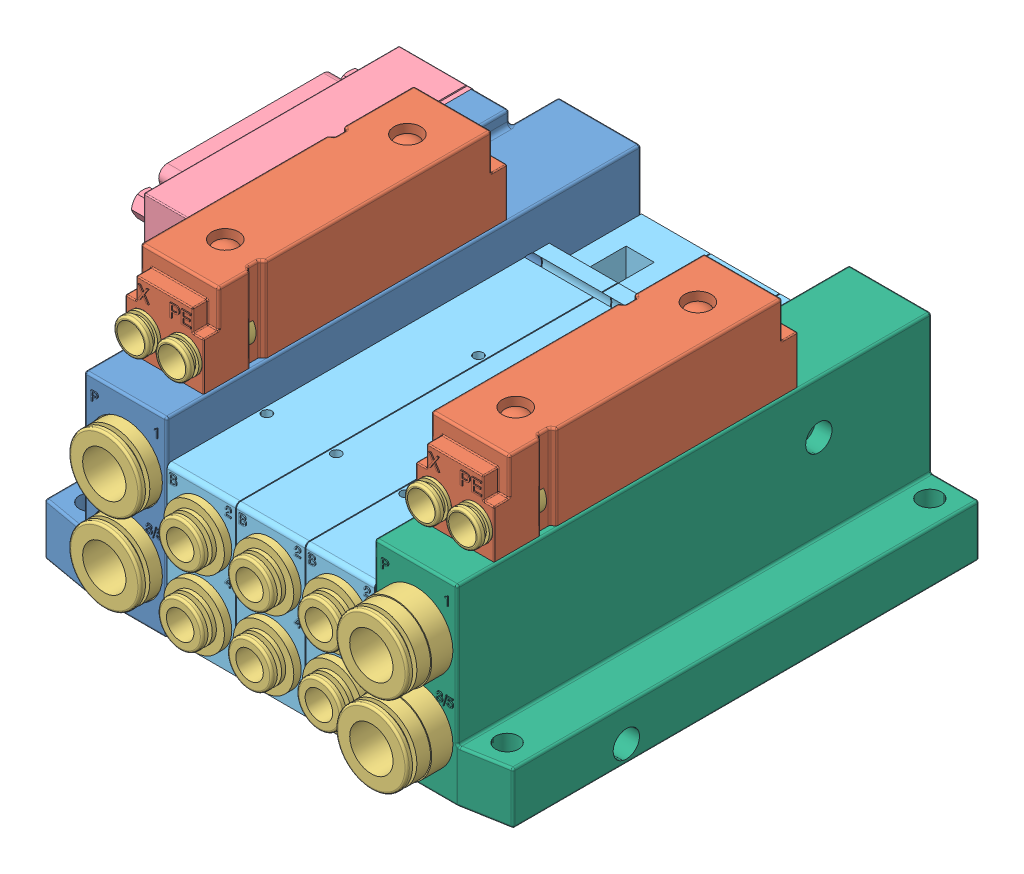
SolidWorks assembly 45642-048.SLDASM, configuration SS5V2-10FD2-06BR-N7 (file format 4400). Lengths in mm.
Overall size (128.4 63.5 119.7).
31 component instances, 7 part files, 6 mates.
Components (placement in the parent):
- SS5V2-10FD2-06BR-N7_Input Block-1: SS5V2-10FD2-06BR-N7_Input Block.sldasm [10F2-R] at origin size (50.4 63.5 114.3)
  - SS5V2-10FD2-06BR-N7_Input Side End Plate-1: SS5V2-10FD2-06BR-N7_Input Side End Plate.sldprt [10] at (-9.5 22 1.3) size (30 47.25 109.72)
  - Rail Clamp-1: Rail Clamp.sldprt [Default] at (-24 0 -8.5) x (-1 0 0) z (0 0 -1) (suppressed, hidden)
  - Rail Clamp-2: Rail Clamp.sldprt [0] at (-22.5 10 -7.8) x (-1 0 0) z (0 0 -1) (suppressed, hidden)
  - SS5V2-10FD2-06BR-N7_Exhaust Cap-1: SS5V2-10FD2-06BR-N7_Exhaust Cap.SLDPRT [R] at (-9.5 55 12) size (18.3 19.5 70.25)
  - SS5V2-10FD2-06BR-N7_Fittings-4: SS5V2-10FD2-06BR-N7_Fittings.sldprt [1000-51A-N11] at (-9.5 30.6 26.4) size (17 17 34.5)
  - SS5V2-10FD2-06BR-N7_Fittings-3: SS5V2-10FD2-06BR-N7_Fittings.sldprt [1000-51A-N11] at (-9.5 11.9 26.4) size (17 17 34.5)
  - SS5V2-10FD2-06BR-N7_Fittings-2: SS5V2-10FD2-06BR-N7_Fittings.sldprt [0000-50A-N3] at (-14.3 49.9 34.6) size (8 8 15.4)
  - SS5V2-10FD2-06BR-N7_Fittings-1: SS5V2-10FD2-06BR-N7_Fittings.sldprt [0000-50A-N3] at (-4.8 49.9 34.6) size (8 8 15.4)
  - SS5V2-10FD2-06BR-N7_Connector-1: SS5V2-10FD2-06BR-N7_Connector.sldprt [F2] at (-27.4 29.75 -12.55) x (0 0 1) z (-1 0 0) size (58.9 35 23)
- SS5V2-10FD2-06BR-N7_Base-1: SS5V2-10FD2-06BR-N7_Base.sldasm [W10S-N7] at (8 17.75 1.3) size (16 34.5 114.3)
  - SS5V2-10FD2-06BR-N7_Valve Base-1: SS5V2-10FD2-06BR-N7_Valve Base.SLDPRT [W10S] at origin size (16 34.5 109.65)
  - SS5V2-10FD2-06BR-N7_Fittings-2: SS5V2-10FD2-06BR-N7_Fittings.sldprt [1000-51A-N7] at (0 7.45 41.3) size (14 14 18.3)
  - SS5V2-10FD2-06BR-N7_Fittings-1: SS5V2-10FD2-06BR-N7_Fittings.sldprt [1000-51A-N7] at (0 -8.55 41.3) size (14 14 18.3)
- SS5V2-10FD2-06BR-N7_Exhaust Side-1: SS5V2-10FD2-06BR-N7_Exhaust Side.sldasm [W10S-R] at (48 0 0) size (30 63.5 119.7)
  - SS5V2-10FD2-06BR-N7_D Side End Plate-1: SS5V2-10FD2-06BR-N7_D Side End Plate.sldprt [W10S] at (9.5 0 1.3) size (30 44 109.72)
  - Rail Clamp-1: Rail Clamp.sldprt [Default] at (24 0 -8.5) x (-1 0 0) z (0 0 -1) (suppressed, hidden)
  - Rail Clamp-2: Rail Clamp.sldprt [0] at (22.5 10 -7.8) x (-1 0 0) z (0 0 -1) (suppressed, hidden)
  - SS5V2-10FD2-06BR-N7_Exhaust Cap-1: SS5V2-10FD2-06BR-N7_Exhaust Cap.SLDPRT [R] at (9.5 55 12) size (18.3 19.5 70.25)
  - SS5V2-10FD2-06BR-N7_Fittings-4: SS5V2-10FD2-06BR-N7_Fittings.sldprt [1000-51A-N11] at (9.5 30.6 31.8) size (17 17 34.5)
  - SS5V2-10FD2-06BR-N7_Fittings-3: SS5V2-10FD2-06BR-N7_Fittings.sldprt [1000-51A-N11] at (9.5 11.9 31.8) size (17 17 34.5)
  - SS5V2-10FD2-06BR-N7_Fittings-2: SS5V2-10FD2-06BR-N7_Fittings.sldprt [0000-50A-N3] at (4.7 49.9 34.6) size (8 8 15.4)
  - SS5V2-10FD2-06BR-N7_Fittings-1: SS5V2-10FD2-06BR-N7_Fittings.sldprt [0000-50A-N3] at (14.2 49.9 34.6) size (8 8 15.4)
- SS5V2-10FD2-06BR-N7_Base-2: SS5V2-10FD2-06BR-N7_Base.sldasm [W10S-N7] at (24 17.75 1.3) size (16 34.5 114.3)
  - SS5V2-10FD2-06BR-N7_Valve Base-1: SS5V2-10FD2-06BR-N7_Valve Base.SLDPRT [W10S] at origin size (16 34.5 109.65)
  - SS5V2-10FD2-06BR-N7_Fittings-2: SS5V2-10FD2-06BR-N7_Fittings.sldprt [1000-51A-N7] at (0 7.45 41.3) size (14 14 18.3)
  - SS5V2-10FD2-06BR-N7_Fittings-1: SS5V2-10FD2-06BR-N7_Fittings.sldprt [1000-51A-N7] at (0 -8.55 41.3) size (14 14 18.3)
- SS5V2-10FD2-06BR-N7_Base-3: SS5V2-10FD2-06BR-N7_Base.sldasm [W10S-N7] at (40 17.75 1.3) size (16 34.5 114.3)
  - SS5V2-10FD2-06BR-N7_Valve Base-1: SS5V2-10FD2-06BR-N7_Valve Base.SLDPRT [W10S] at origin size (16 34.5 109.65)
  - SS5V2-10FD2-06BR-N7_Fittings-2: SS5V2-10FD2-06BR-N7_Fittings.sldprt [1000-51A-N7] at (0 7.45 41.3) size (14 14 18.3)
  - SS5V2-10FD2-06BR-N7_Fittings-1: SS5V2-10FD2-06BR-N7_Fittings.sldprt [1000-51A-N7] at (0 -8.55 41.3) size (14 14 18.3)
Mates (geometry in assembly coordinates):
- Coincident1: coincident anti-aligned: plane of SS5V2-10FD2-06BR-N7_Input Block-1/SS5V2-10FD2-06BR-N7_Input Side End Plate-1 through (0 0 56) normal (1 0 0); plane of SS5V2-10FD2-06BR-N7_Base-1/SS5V2-10FD2-06BR-N7_Valve Base-1 through (0 0.5 56) normal (-1 0 0)
- Concentric1: concentric aligned: cylinder of SS5V2-10FD2-06BR-N7_Input Block-1/SS5V2-10FD2-06BR-N7_Input Side End Plate-1 through (-12.4767 4 28) axis (1 0 0) radius 3.05; cylinder of SS5V2-10FD2-06BR-N7_Base-1/SS5V2-10FD2-06BR-N7_Valve Base-1 through (0 4 28) axis (1 0 0) radius 3.15
- Coincident4: coincident aligned: plane of SS5V2-10FD2-06BR-N7_Input Block-1/SS5V2-10FD2-06BR-N7_Input Side End Plate-1 through (0 44 56) normal (0 0 1); plane of SS5V2-10FD2-06BR-N7_Base-1/SS5V2-10FD2-06BR-N7_Valve Base-1 through (16 35 56) normal (0 0 1)
- Coincident37: coincident aligned: plane of SS5V2-10FD2-06BR-N7_Input Block-1/SS5V2-10FD2-06BR-N7_Input Side End Plate-1 through (0 44 56) normal (0 0 1); plane of SS5V2-10FD2-06BR-N7_Exhaust Side-1/SS5V2-10FD2-06BR-N7_D Side End Plate-1 through (67 44 56) normal (0 0 1)
- Coincident38: coincident aligned: plane of SS5V2-10FD2-06BR-N7_Input Block-1/SS5V2-10FD2-06BR-N7_Input Side End Plate-1 through (0 0 56) normal (0 -1 0); plane of SS5V2-10FD2-06BR-N7_Exhaust Side-1/SS5V2-10FD2-06BR-N7_D Side End Plate-1 through (67 0 56) normal (0 -1 0)
- Coincident39: coincident anti-aligned: plane of SS5V2-10FD2-06BR-N7_Exhaust Side-1/SS5V2-10FD2-06BR-N7_D Side End Plate-1 through (48 0 56) normal (-1 0 0); plane of assembly through (48 0 0) normal (1 0 0)
